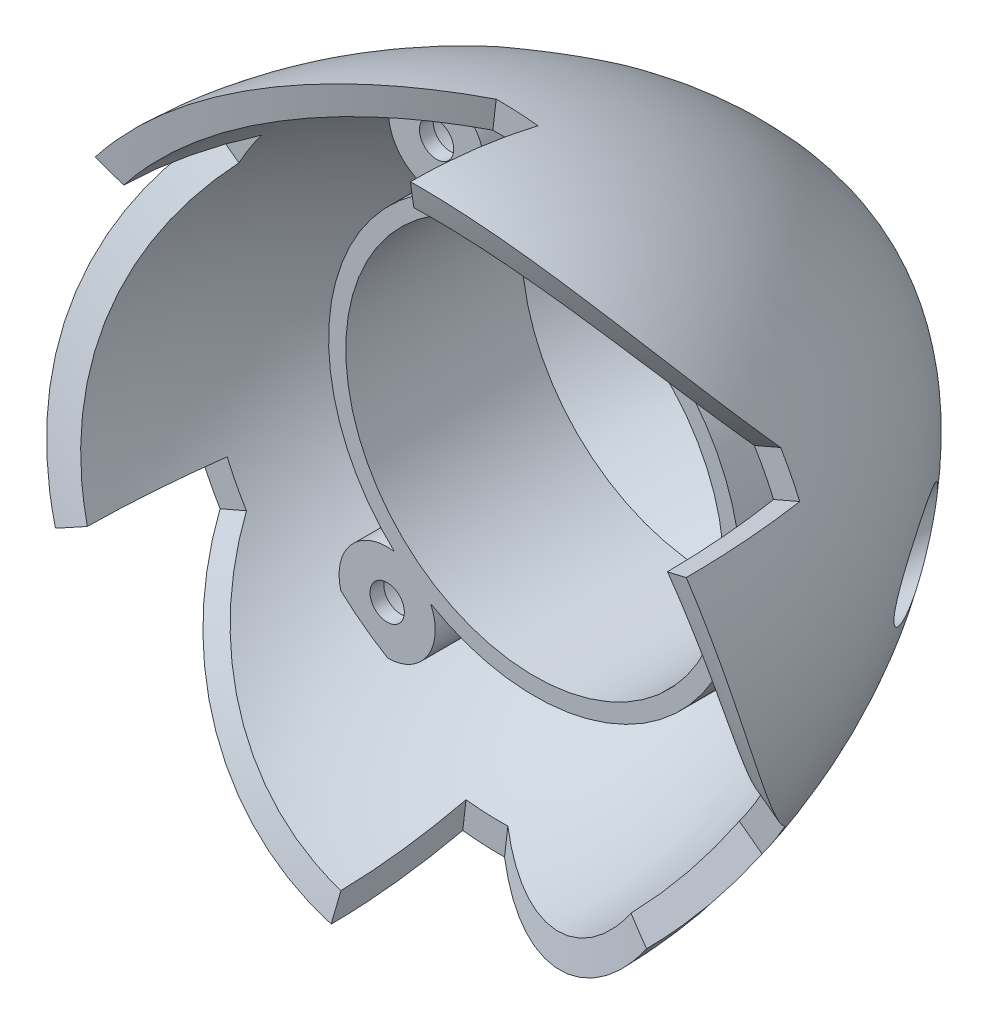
from build123d import *

# Parameters (mm, degrees)
COQUE1_T                     = -2
R_P_TITION_CIRCULAIRE1_COUNT = 6
BOSS_EXTRU_1_REACH           = 63.628
BOSS_EXTRU_1_START           = -12
ESQUISSE5_R                  = 15
ESQUISSE5_R_2                = 13.75
BOSS_EXTRU_2_REACH           = 44.035
ESQUISSE6_R                  = 3.5
ESQUISSE7_R                  = 1.25
ENL_V_MAT_EXTRU_1_DEPTH      = 43.03458394
ENL_V_START                  = -1
ESQUISSE8_R                  = 2.75
ENL_V_MAT_EXTRU_2_DEPTH      = 42.03458394


with BuildPart() as part:
    # Esquisse1 → R_volution1 (revolve)
    with BuildSketch(Plane(origin=(0, 0, 0), x_dir=(0, 0, -1), z_dir=(1, 0, 0))):
        with BuildLine():
            Line((0, 25), (0, 0))
            Line((0, 0), (35, 0))
            add(Edge.make_bspline(
                [(35, 0), (35, 12), (17, 25), (0, 25)],
                knots=[0, 0, 0, 0, 1, 1, 1, 1], degree=3))
        make_face()
    revolve(axis=Axis((0, 0, 0), (0, 0, -1)))

    # Coque1
    coque1_openings = [part.faces().sort_by_distance(p)[0] for p in [
        (0, 0, 0),
    ]]
    offset(amount=COQUE1_T, openings=coque1_openings, kind=Kind.INTERSECTION)

    # Esquisse3 for Enl_vement d → Enl_vement de mati_re-Lissage1 section 0
    with BuildSketch(Plane(origin=(-2.882125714, -24.833311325, 0), x_dir=(0.9933324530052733, -0.11528502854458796, 0), z_dir=(-0.11528502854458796, -0.9933324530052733, 0))):
        with BuildLine():
            Line((0, -9.5), (0, 2.124232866))
            Line((0, 2.124232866), (23.003652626, 2.124232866))
            Line((23.003652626, 2.124232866), (23.003652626, 0.250525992))
            # circular arc as an exact rational Bezier (weights 1, cos(half-angle), 1)
            Bezier((23.003652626, 0.250525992), (11.86647309, -2.261700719), (3.037255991, -9.5), weights=[1, 0.973111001, 1])
            Line((3.037255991, -9.5), (0, -9.5))
        make_face()
    # Esquisse4 for Enl_vement d → Enl_vement de mati_re-Lissage1 section 1
    with BuildSketch(Plane(origin=(-0.831266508, -7.162456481, 0), x_dir=(-0.9933324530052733, 0.11528502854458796, 0), z_dir=(0.11528502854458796, 0.9933324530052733, 0))):
        with BuildLine():
            Line((-3.037255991, -9.5), (0, -9.5))
            Line((0, -9.5), (0, 2.124232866))
            Line((0, 2.124232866), (-23.003652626, 2.124232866))
            Line((-23.003652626, 2.124232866), (-23.003652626, 0.250525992))
            Bezier((-23.003652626, 0.250525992), (-11.86647309, -2.261700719), (-3.037255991, -9.5), weights=[1, 0.973111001, 1])
        make_face()
    enl_vement_de_mati_re_lissage1 = loft(mode=Mode.SUBTRACT)

    # R_p_tition circulaire1: Enl_vement de mati_re-Lissage1 ×6 about axis
    r_p_tition_circulaire1_axis = Axis((0, 0, 0), (0, 0, 1))
    for i in range(1, R_P_TITION_CIRCULAIRE1_COUNT):
        add(enl_vement_de_mati_re_lissage1.rotate(r_p_tition_circulaire1_axis, i * 360 / R_P_TITION_CIRCULAIRE1_COUNT), mode=Mode.SUBTRACT)

    # Esquisse5 → Boss.-Extru.1 (add, up to next)
    with BuildSketch(Plane.XY.offset(BOSS_EXTRU_1_START), mode=Mode.PRIVATE) as boss_extru_1_sk1:
        Circle(ESQUISSE5_R)
        Circle(ESQUISSE5_R_2, mode=Mode.SUBTRACT)
    boss_extru_1_tool1 = extrude(boss_extru_1_sk1.sketch, amount=-BOSS_EXTRU_1_REACH, mode=Mode.PRIVATE) - part.part
    add(boss_extru_1_tool1.solids().sort_by_distance((-14.575736, 0, -12))[0])

    # Esquisse6 → Boss.-Extru.2 (add, up to next)
    with BuildSketch(Plane.XY.offset(-12), mode=Mode.PRIVATE) as boss_extru_2_sk1:
        with Locations((17.879984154, -2.075130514)):
            Circle(ESQUISSE6_R)
    boss_extru_2_tool1 = extrude(boss_extru_2_sk1.sketch, amount=-BOSS_EXTRU_2_REACH, mode=Mode.PRIVATE) - part.part
    # Esquisse6 → Boss.-Extru.2 (add, up to next)
    with BuildSketch(Plane.XY.offset(-12), mode=Mode.PRIVATE) as boss_extru_2_sk2:
        with Locations((-10.737107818, -14.44695524)):
            Circle(ESQUISSE6_R)
    boss_extru_2_tool2 = extrude(boss_extru_2_sk2.sketch, amount=-BOSS_EXTRU_2_REACH, mode=Mode.PRIVATE) - part.part
    # Esquisse6 → Boss.-Extru.2 (add, up to next)
    with BuildSketch(Plane.XY.offset(-12), mode=Mode.PRIVATE) as boss_extru_2_sk3:
        with Locations((-7.142876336, 16.522085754)):
            Circle(ESQUISSE6_R)
    boss_extru_2_tool3 = extrude(boss_extru_2_sk3.sketch, amount=-BOSS_EXTRU_2_REACH, mode=Mode.PRIVATE) - part.part
    add(boss_extru_2_tool1.solids().sort_by_distance((17.879984, -2.075131, -12))[0])
    add(boss_extru_2_tool2.solids().sort_by_distance((-10.737108, -14.446955, -12))[0])
    add(boss_extru_2_tool3.solids().sort_by_distance((-7.142876, 16.522086, -12))[0])

    # Esquisse7 → Enl_v. mat.-Extru.1 (cut, through all)
    with BuildSketch(Plane.XY.offset(-12)):
        with Locations((17.879984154, -2.075130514)):
            Circle(ESQUISSE7_R)
        with Locations((-10.737107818, -14.44695524)):
            Circle(ESQUISSE7_R)
        with Locations((-7.142876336, 16.522085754)):
            Circle(ESQUISSE7_R)
    extrude(amount=-ENL_V_MAT_EXTRU_1_DEPTH, mode=Mode.SUBTRACT)

    # Esquisse8 → Enl_v. mat.-Extru.2 (cut, through all)
    with BuildSketch(Plane.XY.offset(-12).offset(ENL_V_START)):
        with Locations((17.879984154, -2.075130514)):
            Circle(ESQUISSE8_R)
        with Locations((-10.737107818, -14.44695524)):
            Circle(ESQUISSE8_R)
        with Locations((-7.142876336, 16.522085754)):
            Circle(ESQUISSE8_R)
    extrude(amount=-ENL_V_MAT_EXTRU_2_DEPTH, mode=Mode.SUBTRACT)


solid = part.part
